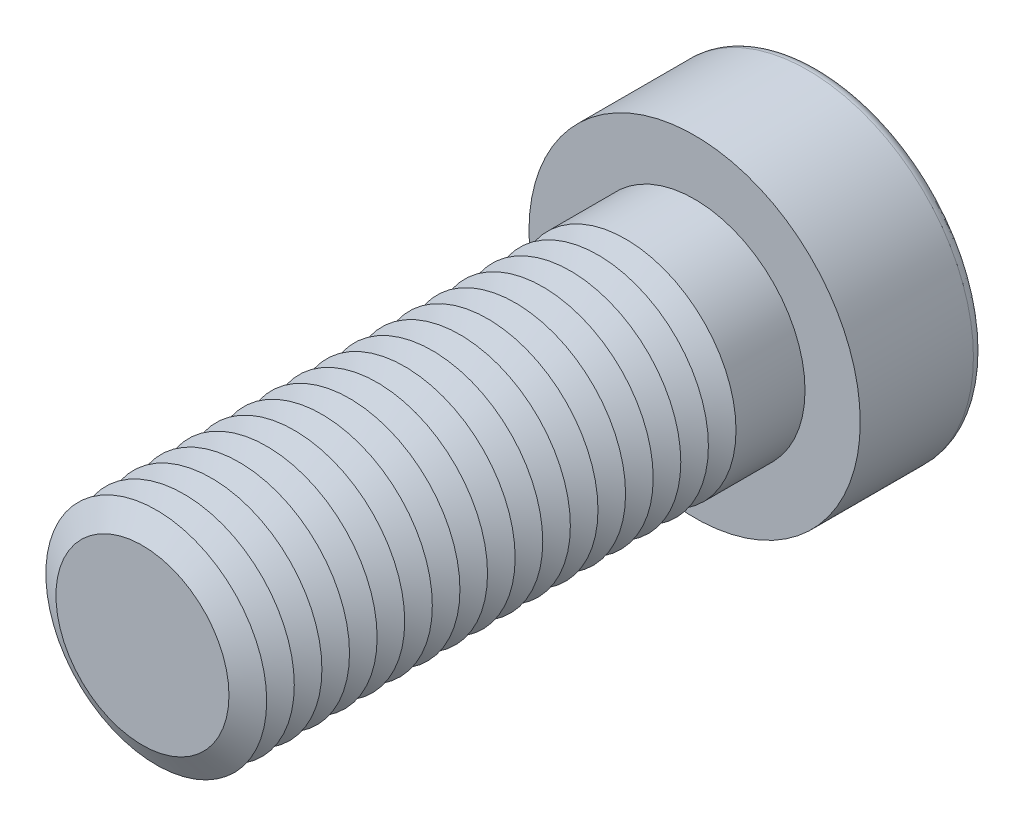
from build123d import *

# Parameters (mm, degrees)
SKETCH1_R           = 8
BOSS_EXTRUDE1_DEPTH = 40
SKETCH2_R           = 12
BOSS_EXTRUDE2_DEPTH = 9
CUT_EXTRUDE1_DEPTH  = 9
FILLET1_R           = 0.8
LPATTERN1_COUNT     = 18
LPATTERN1_PITCH     = 2


with BuildPart() as part:
    # Sketch1 → Boss-Extrude1 (new body)
    with BuildSketch(Plane.XY):
        Circle(SKETCH1_R)
    extrude(amount=BOSS_EXTRUDE1_DEPTH)

    # Sketch2 → Boss-Extrude2 (add)
    with BuildSketch(Plane(origin=(0, 0, 0), x_dir=(-1, 0, 0), z_dir=(0, 0, -1))):
        Circle(SKETCH2_R)
    extrude(amount=BOSS_EXTRUDE2_DEPTH)

    # Sketch3 → Cut-Extrude1 (cut)
    with BuildSketch(Plane(origin=(0, 0, -9), x_dir=(-1, 0, 0), z_dir=(0, 0, -1))):
        Polygon((-3.464101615, 6), (-6.92820323, 0), (-3.464101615, -6), (3.464101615, -6), (6.92820323, 0), (3.464101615, 6), align=None)
    extrude(amount=-CUT_EXTRUDE1_DEPTH, mode=Mode.SUBTRACT)

    # Fillet1
    fillet1_edges = [part.edges().sort_by_distance(p)[0] for p in [
        (12, 0, -9),
    ]]
    fillet(fillet1_edges, radius=FILLET1_R)

    # Cut-Extrude2 cone 1 section (on through the dimple's axis) → Cut-Extrude2 (revolve, cut)
    with BuildSketch(Plane.YZ):
        Polygon((0, 0), (6, 0), (0, 3.464101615), align=None)
    revolve(axis=Axis((0, 0, 0), (0, 0, 1)), mode=Mode.SUBTRACT)

    # Cut-Extrude3 cone 1 section (on through the dimple's axis) → Cut-Extrude3 (revolve, cut)
    with BuildSketch(Plane(origin=(0, 0, -9), x_dir=(0, 1, 0), z_dir=(1, 0, 0))):
        Polygon((0, 0), (6.92820323, 0), (0, 1.856406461), align=None)
    revolve(axis=Axis((0, 0, -9), (0, 0, 1)), mode=Mode.SUBTRACT)

    # Sketch7 → Cut-Revolve1 (revolve, cut)
    with BuildSketch(Plane(origin=(0, 0, 0), x_dir=(0, 0, -1), z_dir=(1, 0, 0)), mode=Mode.PRIVATE) as cut_revolve1_sk:
        Polygon((-40, 6.267949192), (-39, 8), (-41, 8), align=None)
    cut_revolve1 = revolve(cut_revolve1_sk.sketch.rotate(Axis((0, 0, 40), (0, 0, -1)), 90), axis=Axis((0, 0, 40), (0, 0, -1)), mode=Mode.SUBTRACT)

    # LPattern1: Cut-Revolve1 ×18
    with Locations(*[(0, 0, -i * LPATTERN1_PITCH) for i in range(1, LPATTERN1_COUNT)]):
        add(cut_revolve1, mode=Mode.SUBTRACT)


solid = part.part
